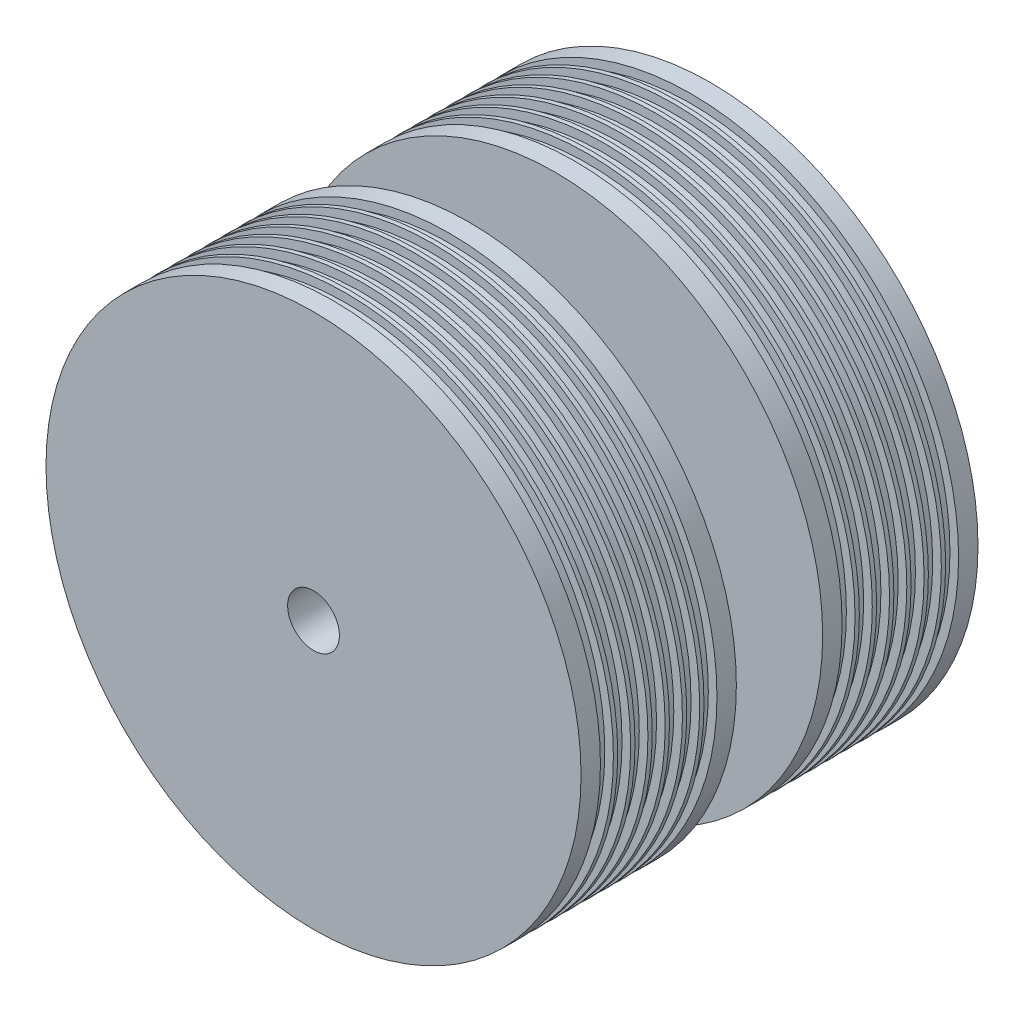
from build123d import *

# Parameters (mm, degrees)
SKETCH1_W = 0.5
SKETCH1_H = 0.75


with BuildPart() as part:
    # Sketch1 → Revolve2 (revolve)
    with BuildSketch(Plane(origin=(0, 0, 0), x_dir=(1, 0, 0), z_dir=(0, 1, 0))):
        Polygon((15.5, 9), (1.5, 9), (1.5, 0), (15.5, 0), (15.5, 0.125), (15, 0.125), (15, 0.875), (15.5, 0.875), (15.5, 1.125), (15, 1.125), (15, 1.875), (15.5, 1.875), (15.5, 2.125), (15, 2.125), (15, 2.875), (15.5, 2.875), (15.5, 3.125), (15, 3.125), (15, 3.875), (15.5, 3.875), (15.5, 4.125), (15, 4.125), (15, 4.875), (15.5, 4.875), (15.5, 5.125), (15, 5.125), (15, 5.875), (15.5, 5.875), (15.5, 6.125), (15, 6.125), (15, 6.875), (15.5, 6.875), (15.5, 7.125), (15, 7.125), (15, 7.875), (15.5, 7.875), (15.5, 8.125), (15, 8.125), (15, 8.875), (15.5, 8.875), align=None)
        Polygon((15, 20.875), (15.5, 20.875), (15.5, 21.125), (15, 21.125), (15, 21.875), (15.5, 21.875), (15.5, 23), (1.5, 23), (1.5, 14), (15.5, 14), (15.5, 14.125), (15, 14.125), (15, 14.875), (15.5, 14.875), (15.5, 15.125), (15, 15.125), (15, 15.875), (15.5, 15.875), (15.5, 16.125), (15, 16.125), (15, 16.875), (15.5, 16.875), (15.5, 17.125), (15, 17.125), (15, 17.875), (15.5, 17.875), (15.5, 18.125), (15, 18.125), (15, 18.875), (15.5, 18.875), (15.5, 19.125), (15, 19.125), (15, 19.875), (15.5, 19.875), (15.5, 20.125), (15, 20.125), align=None)
        with Locations((15.25, 14.5)):
            Rectangle(SKETCH1_W, SKETCH1_H)
        with Locations((15.25, 8.5)):
            Rectangle(SKETCH1_W, SKETCH1_H)
        with Locations((15.25, 0.5)):
            Rectangle(SKETCH1_W, SKETCH1_H)
    revolve(axis=Axis((0, 0, 0), (0, 0, -1)))


solid = part.part
